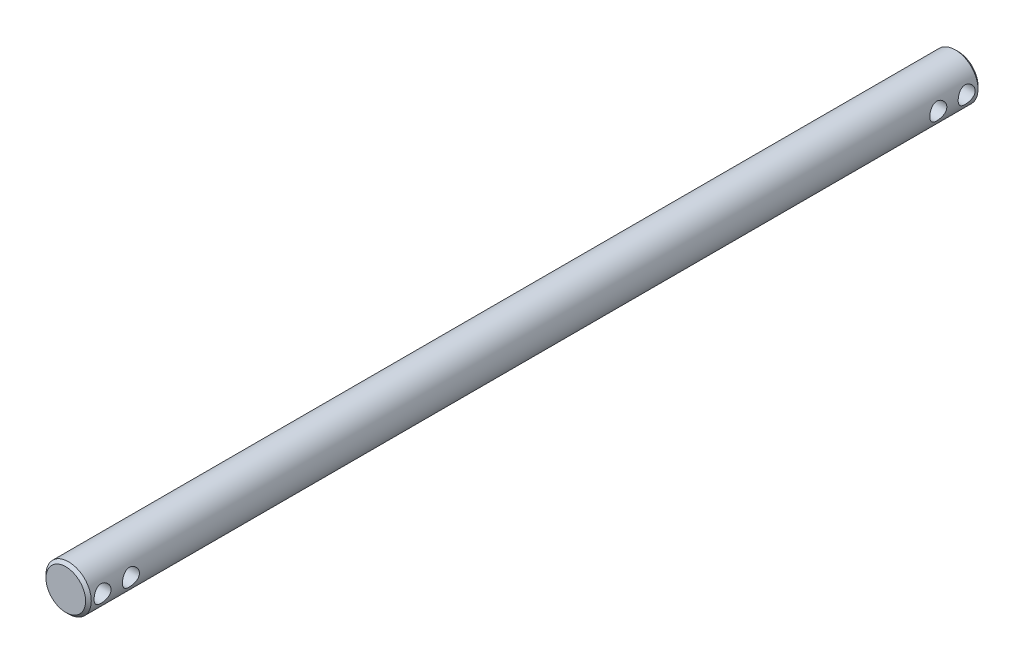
ISO-10303-21;
HEADER;
FILE_DESCRIPTION(('STEP AP214'),'2;1');
FILE_NAME('part.step','',(''),(''),'','','');
FILE_SCHEMA(('AUTOMOTIVE_DESIGN { 1 0 10303 214 1 1 1 1 }'));
ENDSEC;
DATA;
#1=APPLICATION_CONTEXT('core data for automotive mechanical design processes');
#2=APPLICATION_PROTOCOL_DEFINITION('international standard','automotive_design',2000,#1);
#3=PRODUCT_CONTEXT('',#1,'mechanical');
#4=PRODUCT('Part','Part','',(#3));
#5=PRODUCT_RELATED_PRODUCT_CATEGORY('part','',(#4));
#6=PRODUCT_DEFINITION_FORMATION('','',#4);
#7=PRODUCT_DEFINITION_CONTEXT('part definition',#1,'design');
#8=PRODUCT_DEFINITION('design','',#6,#7);
#9=PRODUCT_DEFINITION_SHAPE('','',#8);
#10=(LENGTH_UNIT() NAMED_UNIT(*) SI_UNIT(.MILLI.,.METRE.));
#11=(NAMED_UNIT(*) PLANE_ANGLE_UNIT() SI_UNIT($,.RADIAN.));
#12=(NAMED_UNIT(*) SI_UNIT($,.STERADIAN.) SOLID_ANGLE_UNIT());
#13=UNCERTAINTY_MEASURE_WITH_UNIT(LENGTH_MEASURE(1.E-05),#10,'distance_accuracy_value','');
#14=(GEOMETRIC_REPRESENTATION_CONTEXT(3) GLOBAL_UNCERTAINTY_ASSIGNED_CONTEXT((#13)) GLOBAL_UNIT_ASSIGNED_CONTEXT((#10,
#11,#12)) REPRESENTATION_CONTEXT('',''));
#15=CARTESIAN_POINT('',(0.,0.,0.));
#16=DIRECTION('',(0.,0.,1.));
#17=DIRECTION('',(1.,0.,0.));
#18=AXIS2_PLACEMENT_3D('',#15,#16,#17);
#19=CARTESIAN_POINT('',(0.,0.,315.));
#20=DIRECTION('',(0.,0.,-1.));
#21=DIRECTION('',(-1.,0.,0.));
#22=AXIS2_PLACEMENT_3D('',#19,#20,#21);
#23=CYLINDRICAL_SURFACE('',#22,8.);
#24=CARTESIAN_POINT('',(0.,0.,1.));
#25=DIRECTION('',(0.,0.,1.));
#26=DIRECTION('',(1.,0.,0.));
#27=AXIS2_PLACEMENT_3D('',#24,#25,#26);
#28=CIRCLE('',#27,8.);
#29=CARTESIAN_POINT('',(8.,0.,1.));
#30=VERTEX_POINT('',#29);
#31=EDGE_CURVE('E39',#30,#30,#28,.T.);
#32=ORIENTED_EDGE('',*,*,#31,.T.);
#33=EDGE_LOOP('',(#32));
#34=FACE_BOUND('',#33,.T.);
#35=CARTESIAN_POINT('',(0.,0.,314.));
#36=DIRECTION('',(0.,0.,1.));
#37=DIRECTION('',(1.,0.,0.));
#38=AXIS2_PLACEMENT_3D('',#35,#36,#37);
#39=CIRCLE('',#38,8.);
#40=CARTESIAN_POINT('',(8.,0.,314.));
#41=VERTEX_POINT('',#40);
#42=EDGE_CURVE('E43',#41,#41,#39,.F.);
#43=ORIENTED_EDGE('',*,*,#42,.T.);
#44=EDGE_LOOP('',(#43));
#45=FACE_BOUND('',#44,.T.);
#46=CARTESIAN_POINT('',(-8.,0.,313.));
#47=CARTESIAN_POINT('',(-8.00000434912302,-0.162470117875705,313.000005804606));
#48=CARTESIAN_POINT('',(-7.99500758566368,-0.324900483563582,312.986760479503));
#49=CARTESIAN_POINT('',(-7.97557392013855,-0.644906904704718,312.93434360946));
#50=CARTESIAN_POINT('',(-7.96113837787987,-0.802483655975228,312.895175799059));
#51=CARTESIAN_POINT('',(-7.92437664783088,-1.10812156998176,312.792493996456));
#52=CARTESIAN_POINT('',(-7.90206568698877,-1.25620044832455,312.729026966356));
#53=CARTESIAN_POINT('',(-7.85177535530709,-1.5395986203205,312.579787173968));
#54=CARTESIAN_POINT('',(-7.82379446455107,-1.67491447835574,312.494008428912));
#55=CARTESIAN_POINT('',(-7.76372493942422,-1.93469283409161,312.298774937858));
#56=CARTESIAN_POINT('',(-7.73152005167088,-2.05854146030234,312.188539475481));
#57=CARTESIAN_POINT('',(-7.66720441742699,-2.28648842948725,311.949179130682));
#58=CARTESIAN_POINT('',(-7.63509370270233,-2.39058072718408,311.820048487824));
#59=CARTESIAN_POINT('',(-7.57324941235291,-2.57996404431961,311.540565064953));
#60=CARTESIAN_POINT('',(-7.54365297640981,-2.66438786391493,311.389591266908));
#61=CARTESIAN_POINT('',(-7.49199720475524,-2.80637292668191,311.074303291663));
#62=CARTESIAN_POINT('',(-7.46993485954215,-2.86394489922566,310.909994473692));
#63=CARTESIAN_POINT('',(-7.4370882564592,-2.94816862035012,310.579766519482));
#64=CARTESIAN_POINT('',(-7.42587848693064,-2.97599186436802,310.414189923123));
#65=CARTESIAN_POINT('',(-7.41476122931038,-3.00359113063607,310.080367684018));
#66=CARTESIAN_POINT('',(-7.41484907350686,-3.00337873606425,309.912123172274));
#67=CARTESIAN_POINT('',(-7.42595023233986,-2.97580859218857,309.588460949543));
#68=CARTESIAN_POINT('',(-7.43630937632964,-2.9500761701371,309.432878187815));
#69=CARTESIAN_POINT('',(-7.46569876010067,-2.87488335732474,309.128425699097));
#70=CARTESIAN_POINT('',(-7.48473030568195,-2.82541939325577,308.979556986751));
#71=CARTESIAN_POINT('',(-7.52971404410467,-2.70327497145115,308.689445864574));
#72=CARTESIAN_POINT('',(-7.55579035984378,-2.63017297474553,308.548401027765));
#73=CARTESIAN_POINT('',(-7.61188420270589,-2.46312147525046,308.28010852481));
#74=CARTESIAN_POINT('',(-7.64190308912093,-2.36916477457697,308.152865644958));
#75=CARTESIAN_POINT('',(-7.70496077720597,-2.15563561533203,307.906792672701));
#76=CARTESIAN_POINT('',(-7.73806694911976,-2.03476597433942,307.789102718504));
#77=CARTESIAN_POINT('',(-7.80183456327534,-1.7746251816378,307.575324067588));
#78=CARTESIAN_POINT('',(-7.83249562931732,-1.63535120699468,307.479238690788));
#79=CARTESIAN_POINT('',(-7.88852789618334,-1.33944687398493,307.310139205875));
#80=CARTESIAN_POINT('',(-7.91380996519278,-1.18258142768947,307.237504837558));
#81=CARTESIAN_POINT('',(-7.95557436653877,-0.857673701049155,307.12003479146));
#82=CARTESIAN_POINT('',(-7.97206060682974,-0.689636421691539,307.075186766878));
#83=CARTESIAN_POINT('',(-7.99368886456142,-0.356750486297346,307.016754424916));
#84=CARTESIAN_POINT('',(-7.99938738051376,-0.192207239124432,307.001634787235));
#85=CARTESIAN_POINT('',(-8.00051787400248,0.137144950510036,306.9986178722));
#86=CARTESIAN_POINT('',(-7.99595212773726,0.301953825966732,307.010714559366));
#87=CARTESIAN_POINT('',(-7.97743419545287,0.6205240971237,307.060620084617));
#88=CARTESIAN_POINT('',(-7.9638494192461,0.77446665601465,307.097423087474));
#89=CARTESIAN_POINT('',(-7.92902954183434,1.07388350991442,307.194372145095));
#90=CARTESIAN_POINT('',(-7.90779344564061,1.21935670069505,307.254521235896));
#91=CARTESIAN_POINT('',(-7.85899248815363,1.5024955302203,307.398372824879));
#92=CARTESIAN_POINT('',(-7.83126000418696,1.63980616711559,307.482715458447));
#93=CARTESIAN_POINT('',(-7.77253343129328,1.89878542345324,307.671836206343));
#94=CARTESIAN_POINT('',(-7.74153814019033,2.02044824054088,307.77662186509));
#95=CARTESIAN_POINT('',(-7.6774665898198,2.25206159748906,308.010808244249));
#96=CARTESIAN_POINT('',(-7.64437393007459,2.36092308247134,308.141284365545));
#97=CARTESIAN_POINT('',(-7.58157631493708,2.55542100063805,308.419302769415));
#98=CARTESIAN_POINT('',(-7.55187166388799,2.64105534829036,308.566846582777));
#99=CARTESIAN_POINT('',(-7.49933659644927,2.78675547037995,308.876031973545));
#100=CARTESIAN_POINT('',(-7.47653520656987,2.84671370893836,309.037729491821));
#101=CARTESIAN_POINT('',(-7.4410806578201,2.93815766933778,309.370019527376));
#102=CARTESIAN_POINT('',(-7.42842122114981,2.9696610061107,309.540606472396));
#103=CARTESIAN_POINT('',(-7.41551789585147,3.00172694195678,309.874032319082));
#104=CARTESIAN_POINT('',(-7.41452889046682,3.00414662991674,310.036665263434));
#105=CARTESIAN_POINT('',(-7.42316825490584,2.98273431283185,310.359890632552));
#106=CARTESIAN_POINT('',(-7.43279561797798,2.95890479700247,310.520483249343));
#107=CARTESIAN_POINT('',(-7.46096283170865,2.88711631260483,310.830094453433));
#108=CARTESIAN_POINT('',(-7.47922170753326,2.83991596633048,310.979316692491));
#109=CARTESIAN_POINT('',(-7.52243096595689,2.72339393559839,311.267811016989));
#110=CARTESIAN_POINT('',(-7.54738303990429,2.65406665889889,311.40708057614));
#111=CARTESIAN_POINT('',(-7.60279447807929,2.49104151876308,311.679653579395));
#112=CARTESIAN_POINT('',(-7.63347396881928,2.39625665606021,311.8122615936));
#113=CARTESIAN_POINT('',(-7.69612493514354,2.18668971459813,312.060283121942));
#114=CARTESIAN_POINT('',(-7.7280968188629,2.07190128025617,312.175691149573));
#115=CARTESIAN_POINT('',(-7.79180849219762,1.81816079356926,312.392403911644));
#116=CARTESIAN_POINT('',(-7.82344209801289,1.678237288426,312.492607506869));
#117=CARTESIAN_POINT('',(-7.88109028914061,1.38242644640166,312.668045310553));
#118=CARTESIAN_POINT('',(-7.90710443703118,1.22653786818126,312.743277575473));
#119=CARTESIAN_POINT('',(-7.9514858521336,0.895998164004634,312.868753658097));
#120=CARTESIAN_POINT('',(-7.96947314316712,0.720826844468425,312.917774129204));
#121=CARTESIAN_POINT('',(-7.99372484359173,0.363751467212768,312.983385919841));
#122=CARTESIAN_POINT('',(-7.99999513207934,0.181850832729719,312.999993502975));
#123=CARTESIAN_POINT('',(-8.,0.,313.));
#124=B_SPLINE_CURVE_WITH_KNOTS('',3,(#46,#47,#48,#49,#50,#51,#52,#53,#54,#55,#56,#57,#58,#59,
#60,#61,#62,#63,#64,#65,#66,#67,#68,#69,#70,#71,#72,#73,#74,#75,#76,#77,#78,#79,#80,#81,#82,#83,
#84,#85,#86,#87,#88,#89,#90,#91,#92,#93,#94,#95,#96,#97,#98,#99,#100,#101,#102,#103,#104,#105,
#106,#107,#108,#109,#110,#111,#112,#113,#114,#115,#116,#117,#118,#119,#120,#121,#122,#123),
.UNSPECIFIED.,.T.,.F.,(4,2,2,2,2,2,2,2,2,2,2,2,2,2,2,2,2,2,2,2,2,2,2,2,2,2,2,2,2,2,2,2,2,2,2,2,
2,2,4),(0.,0.486739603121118,0.973409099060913,1.45914273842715,1.94500675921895,
2.44947237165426,2.95409209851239,3.47793349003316,4.00156538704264,4.50371748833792,
5.00566212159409,5.47756690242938,5.94954276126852,6.43044816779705,6.91151981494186,
7.42492306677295,7.93840515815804,8.45982750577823,8.98101799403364,9.47450039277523,
9.96787336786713,10.4422887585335,10.9167658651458,11.4051844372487,11.8937836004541,
12.4107303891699,12.9277235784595,13.4468613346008,13.9656774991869,14.4511752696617,
14.9366270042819,15.4072628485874,15.8780177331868,16.3734494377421,16.8690388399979,
17.3914465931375,17.9138949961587,18.4589703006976,19.0037720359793),.UNSPECIFIED.);
#125=CARTESIAN_POINT('',(-8.,0.,313.));
#126=VERTEX_POINT('',#125);
#127=EDGE_CURVE('E53',#126,#126,#124,.T.);
#128=ORIENTED_EDGE('',*,*,#127,.T.);
#129=EDGE_LOOP('',(#128));
#130=FACE_BOUND('',#129,.T.);
#131=CARTESIAN_POINT('',(8.,0.,307.));
#132=CARTESIAN_POINT('',(8.00000434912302,-0.162470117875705,306.999994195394));
#133=CARTESIAN_POINT('',(7.99500758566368,-0.324900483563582,307.013239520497));
#134=CARTESIAN_POINT('',(7.97557392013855,-0.644906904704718,307.06565639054));
#135=CARTESIAN_POINT('',(7.96113837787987,-0.802483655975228,307.104824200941));
#136=CARTESIAN_POINT('',(7.92437664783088,-1.10812156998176,307.207506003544));
#137=CARTESIAN_POINT('',(7.90206568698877,-1.25620044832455,307.270973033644));
#138=CARTESIAN_POINT('',(7.85177535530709,-1.5395986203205,307.420212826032));
#139=CARTESIAN_POINT('',(7.82379446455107,-1.67491447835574,307.505991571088));
#140=CARTESIAN_POINT('',(7.76372493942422,-1.93469283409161,307.701225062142));
#141=CARTESIAN_POINT('',(7.73152005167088,-2.05854146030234,307.811460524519));
#142=CARTESIAN_POINT('',(7.66720441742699,-2.28648842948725,308.050820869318));
#143=CARTESIAN_POINT('',(7.63509370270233,-2.39058072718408,308.179951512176));
#144=CARTESIAN_POINT('',(7.57324941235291,-2.57996404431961,308.459434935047));
#145=CARTESIAN_POINT('',(7.54365297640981,-2.66438786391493,308.610408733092));
#146=CARTESIAN_POINT('',(7.49199720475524,-2.80637292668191,308.925696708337));
#147=CARTESIAN_POINT('',(7.46993485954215,-2.86394489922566,309.090005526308));
#148=CARTESIAN_POINT('',(7.4370882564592,-2.94816862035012,309.420233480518));
#149=CARTESIAN_POINT('',(7.42587848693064,-2.97599186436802,309.585810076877));
#150=CARTESIAN_POINT('',(7.41476122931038,-3.00359113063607,309.919632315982));
#151=CARTESIAN_POINT('',(7.41484907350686,-3.00337873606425,310.087876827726));
#152=CARTESIAN_POINT('',(7.42595023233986,-2.97580859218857,310.411539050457));
#153=CARTESIAN_POINT('',(7.43630937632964,-2.9500761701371,310.567121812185));
#154=CARTESIAN_POINT('',(7.46569876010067,-2.87488335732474,310.871574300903));
#155=CARTESIAN_POINT('',(7.48473030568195,-2.82541939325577,311.020443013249));
#156=CARTESIAN_POINT('',(7.52971404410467,-2.70327497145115,311.310554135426));
#157=CARTESIAN_POINT('',(7.55579035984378,-2.63017297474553,311.451598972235));
#158=CARTESIAN_POINT('',(7.61188420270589,-2.46312147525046,311.71989147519));
#159=CARTESIAN_POINT('',(7.64190308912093,-2.36916477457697,311.847134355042));
#160=CARTESIAN_POINT('',(7.70496077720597,-2.15563561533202,312.093207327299));
#161=CARTESIAN_POINT('',(7.73806694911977,-2.0347659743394,312.210897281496));
#162=CARTESIAN_POINT('',(7.80183456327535,-1.77462518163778,312.424675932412));
#163=CARTESIAN_POINT('',(7.83249562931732,-1.63535120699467,312.520761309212));
#164=CARTESIAN_POINT('',(7.88852789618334,-1.33944687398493,312.689860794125));
#165=CARTESIAN_POINT('',(7.91380996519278,-1.18258142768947,312.762495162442));
#166=CARTESIAN_POINT('',(7.95557436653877,-0.857673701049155,312.87996520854));
#167=CARTESIAN_POINT('',(7.97206060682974,-0.689636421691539,312.924813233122));
#168=CARTESIAN_POINT('',(7.99368886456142,-0.356750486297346,312.983245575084));
#169=CARTESIAN_POINT('',(7.99938738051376,-0.192207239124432,312.998365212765));
#170=CARTESIAN_POINT('',(8.00051787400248,0.137144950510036,313.0013821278));
#171=CARTESIAN_POINT('',(7.99595212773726,0.301953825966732,312.989285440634));
#172=CARTESIAN_POINT('',(7.97743419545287,0.620524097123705,312.939379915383));
#173=CARTESIAN_POINT('',(7.9638494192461,0.774466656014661,312.902576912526));
#174=CARTESIAN_POINT('',(7.92902954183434,1.07388350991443,312.805627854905));
#175=CARTESIAN_POINT('',(7.90779344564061,1.21935670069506,312.745478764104));
#176=CARTESIAN_POINT('',(7.85899248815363,1.5024955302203,312.601627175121));
#177=CARTESIAN_POINT('',(7.83126000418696,1.63980616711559,312.517284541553));
#178=CARTESIAN_POINT('',(7.77253343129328,1.89878542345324,312.328163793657));
#179=CARTESIAN_POINT('',(7.74153814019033,2.02044824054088,312.22337813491));
#180=CARTESIAN_POINT('',(7.6774665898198,2.25206159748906,311.989191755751));
#181=CARTESIAN_POINT('',(7.64437393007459,2.36092308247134,311.858715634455));
#182=CARTESIAN_POINT('',(7.58157631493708,2.55542100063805,311.580697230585));
#183=CARTESIAN_POINT('',(7.55187166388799,2.64105534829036,311.433153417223));
#184=CARTESIAN_POINT('',(7.49933659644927,2.78675547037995,311.123968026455));
#185=CARTESIAN_POINT('',(7.47653520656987,2.84671370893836,310.962270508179));
#186=CARTESIAN_POINT('',(7.4410806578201,2.93815766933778,310.629980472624));
#187=CARTESIAN_POINT('',(7.42842122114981,2.9696610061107,310.459393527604));
#188=CARTESIAN_POINT('',(7.41551789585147,3.00172694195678,310.125967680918));
#189=CARTESIAN_POINT('',(7.41452889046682,3.00414662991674,309.963334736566));
#190=CARTESIAN_POINT('',(7.42316825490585,2.98273431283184,309.640109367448));
#191=CARTESIAN_POINT('',(7.43279561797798,2.95890479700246,309.479516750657));
#192=CARTESIAN_POINT('',(7.46096283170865,2.88711631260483,309.169905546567));
#193=CARTESIAN_POINT('',(7.47922170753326,2.83991596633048,309.020683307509));
#194=CARTESIAN_POINT('',(7.52243096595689,2.72339393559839,308.732188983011));
#195=CARTESIAN_POINT('',(7.54738303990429,2.65406665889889,308.59291942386));
#196=CARTESIAN_POINT('',(7.60279447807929,2.49104151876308,308.320346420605));
#197=CARTESIAN_POINT('',(7.63347396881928,2.39625665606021,308.1877384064));
#198=CARTESIAN_POINT('',(7.69612493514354,2.18668971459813,307.939716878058));
#199=CARTESIAN_POINT('',(7.7280968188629,2.07190128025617,307.824308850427));
#200=CARTESIAN_POINT('',(7.79180849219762,1.81816079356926,307.607596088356));
#201=CARTESIAN_POINT('',(7.82344209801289,1.678237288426,307.507392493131));
#202=CARTESIAN_POINT('',(7.88109028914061,1.38242644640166,307.331954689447));
#203=CARTESIAN_POINT('',(7.90710443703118,1.22653786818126,307.256722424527));
#204=CARTESIAN_POINT('',(7.9514858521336,0.895998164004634,307.131246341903));
#205=CARTESIAN_POINT('',(7.96947314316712,0.720826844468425,307.082225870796));
#206=CARTESIAN_POINT('',(7.99372484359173,0.363751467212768,307.016614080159));
#207=CARTESIAN_POINT('',(7.99999513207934,0.181850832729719,307.000006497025));
#208=CARTESIAN_POINT('',(8.,0.,307.));
#209=B_SPLINE_CURVE_WITH_KNOTS('',3,(#131,#132,#133,#134,#135,#136,#137,#138,#139,#140,#141,
#142,#143,#144,#145,#146,#147,#148,#149,#150,#151,#152,#153,#154,#155,#156,#157,#158,#159,#160,
#161,#162,#163,#164,#165,#166,#167,#168,#169,#170,#171,#172,#173,#174,#175,#176,#177,#178,#179,
#180,#181,#182,#183,#184,#185,#186,#187,#188,#189,#190,#191,#192,#193,#194,#195,#196,#197,#198,
#199,#200,#201,#202,#203,#204,#205,#206,#207,#208),.UNSPECIFIED.,.T.,.F.,(4,2,2,2,2,2,2,2,2,2,2,
2,2,2,2,2,2,2,2,2,2,2,2,2,2,2,2,2,2,2,2,2,2,2,2,2,2,2,4),(0.,0.486739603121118,
0.973409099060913,1.45914273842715,1.94500675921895,2.44947237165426,2.95409209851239,
3.47793349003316,4.00156538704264,4.50371748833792,5.00566212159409,5.47756690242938,
5.94954276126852,6.43044816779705,6.91151981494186,7.42492306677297,7.93840515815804,
8.45982750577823,8.98101799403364,9.47450039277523,9.96787336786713,10.4422887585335,
10.9167658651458,11.4051844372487,11.8937836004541,12.4107303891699,12.9277235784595,
13.4468613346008,13.9656774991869,14.4511752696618,14.9366270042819,15.4072628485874,
15.8780177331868,16.3734494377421,16.8690388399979,17.3914465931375,17.9138949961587,
18.4589703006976,19.0037720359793),.UNSPECIFIED.);
#210=CARTESIAN_POINT('',(8.,0.,307.));
#211=VERTEX_POINT('',#210);
#212=EDGE_CURVE('E61',#211,#211,#209,.T.);
#213=ORIENTED_EDGE('',*,*,#212,.T.);
#214=EDGE_LOOP('',(#213));
#215=FACE_BOUND('',#214,.T.);
#216=CARTESIAN_POINT('',(-8.,0.,303.));
#217=CARTESIAN_POINT('',(-8.00000434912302,-0.162470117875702,303.000005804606));
#218=CARTESIAN_POINT('',(-7.99500758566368,-0.324900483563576,302.986760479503));
#219=CARTESIAN_POINT('',(-7.97557392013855,-0.644906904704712,302.93434360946));
#220=CARTESIAN_POINT('',(-7.96113837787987,-0.802483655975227,302.895175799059));
#221=CARTESIAN_POINT('',(-7.92437664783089,-1.10812156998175,302.792493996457));
#222=CARTESIAN_POINT('',(-7.90206568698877,-1.25620044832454,302.729026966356));
#223=CARTESIAN_POINT('',(-7.8517753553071,-1.53959862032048,302.579787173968));
#224=CARTESIAN_POINT('',(-7.82379446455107,-1.67491447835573,302.494008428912));
#225=CARTESIAN_POINT('',(-7.76372493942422,-1.93469283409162,302.298774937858));
#226=CARTESIAN_POINT('',(-7.73152005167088,-2.05854146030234,302.188539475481));
#227=CARTESIAN_POINT('',(-7.66720441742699,-2.28648842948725,301.949179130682));
#228=CARTESIAN_POINT('',(-7.63509370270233,-2.39058072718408,301.820048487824));
#229=CARTESIAN_POINT('',(-7.57324941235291,-2.57996404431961,301.540565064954));
#230=CARTESIAN_POINT('',(-7.54365297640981,-2.66438786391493,301.389591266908));
#231=CARTESIAN_POINT('',(-7.49199720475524,-2.80637292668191,301.074303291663));
#232=CARTESIAN_POINT('',(-7.46993485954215,-2.86394489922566,300.909994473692));
#233=CARTESIAN_POINT('',(-7.4370882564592,-2.94816862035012,300.579766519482));
#234=CARTESIAN_POINT('',(-7.42587848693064,-2.97599186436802,300.414189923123));
#235=CARTESIAN_POINT('',(-7.41476122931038,-3.00359113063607,300.080367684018));
#236=CARTESIAN_POINT('',(-7.41484907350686,-3.00337873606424,299.912123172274));
#237=CARTESIAN_POINT('',(-7.42595023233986,-2.97580859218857,299.588460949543));
#238=CARTESIAN_POINT('',(-7.43630937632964,-2.95007617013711,299.432878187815));
#239=CARTESIAN_POINT('',(-7.46569876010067,-2.87488335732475,299.128425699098));
#240=CARTESIAN_POINT('',(-7.48473030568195,-2.82541939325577,298.979556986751));
#241=CARTESIAN_POINT('',(-7.52971404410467,-2.70327497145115,298.689445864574));
#242=CARTESIAN_POINT('',(-7.55579035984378,-2.63017297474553,298.548401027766));
#243=CARTESIAN_POINT('',(-7.61188420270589,-2.46312147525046,298.28010852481));
#244=CARTESIAN_POINT('',(-7.64190308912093,-2.36916477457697,298.152865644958));
#245=CARTESIAN_POINT('',(-7.70496077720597,-2.15563561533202,297.906792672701));
#246=CARTESIAN_POINT('',(-7.73806694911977,-2.0347659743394,297.789102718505));
#247=CARTESIAN_POINT('',(-7.80183456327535,-1.77462518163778,297.575324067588));
#248=CARTESIAN_POINT('',(-7.83249562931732,-1.63535120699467,297.479238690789));
#249=CARTESIAN_POINT('',(-7.88852789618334,-1.33944687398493,297.310139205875));
#250=CARTESIAN_POINT('',(-7.91380996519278,-1.18258142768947,297.237504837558));
#251=CARTESIAN_POINT('',(-7.95557436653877,-0.857673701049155,297.12003479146));
#252=CARTESIAN_POINT('',(-7.97206060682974,-0.689636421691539,297.075186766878));
#253=CARTESIAN_POINT('',(-7.99368886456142,-0.356750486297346,297.016754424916));
#254=CARTESIAN_POINT('',(-7.99938738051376,-0.192207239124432,297.001634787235));
#255=CARTESIAN_POINT('',(-8.00051787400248,0.137144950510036,296.9986178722));
#256=CARTESIAN_POINT('',(-7.99595212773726,0.301953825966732,297.010714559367));
#257=CARTESIAN_POINT('',(-7.97743419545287,0.620524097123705,297.060620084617));
#258=CARTESIAN_POINT('',(-7.9638494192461,0.774466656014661,297.097423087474));
#259=CARTESIAN_POINT('',(-7.92902954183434,1.07388350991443,297.194372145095));
#260=CARTESIAN_POINT('',(-7.90779344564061,1.21935670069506,297.254521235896));
#261=CARTESIAN_POINT('',(-7.85899248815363,1.50249553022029,297.398372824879));
#262=CARTESIAN_POINT('',(-7.83126000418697,1.63980616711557,297.482715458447));
#263=CARTESIAN_POINT('',(-7.77253343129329,1.89878542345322,297.671836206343));
#264=CARTESIAN_POINT('',(-7.74153814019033,2.02044824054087,297.77662186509));
#265=CARTESIAN_POINT('',(-7.6774665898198,2.25206159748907,298.010808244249));
#266=CARTESIAN_POINT('',(-7.64437393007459,2.36092308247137,298.141284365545));
#267=CARTESIAN_POINT('',(-7.58157631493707,2.55542100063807,298.419302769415));
#268=CARTESIAN_POINT('',(-7.55187166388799,2.64105534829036,298.566846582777));
#269=CARTESIAN_POINT('',(-7.49933659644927,2.78675547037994,298.876031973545));
#270=CARTESIAN_POINT('',(-7.47653520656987,2.84671370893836,299.037729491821));
#271=CARTESIAN_POINT('',(-7.4410806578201,2.93815766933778,299.370019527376));
#272=CARTESIAN_POINT('',(-7.42842122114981,2.9696610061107,299.540606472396));
#273=CARTESIAN_POINT('',(-7.41551789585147,3.00172694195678,299.874032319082));
#274=CARTESIAN_POINT('',(-7.41452889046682,3.00414662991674,300.036665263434));
#275=CARTESIAN_POINT('',(-7.42316825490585,2.98273431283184,300.359890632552));
#276=CARTESIAN_POINT('',(-7.43279561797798,2.95890479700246,300.520483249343));
#277=CARTESIAN_POINT('',(-7.46096283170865,2.88711631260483,300.830094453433));
#278=CARTESIAN_POINT('',(-7.47922170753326,2.83991596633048,300.979316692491));
#279=CARTESIAN_POINT('',(-7.52243096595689,2.72339393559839,301.267811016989));
#280=CARTESIAN_POINT('',(-7.54738303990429,2.65406665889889,301.40708057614));
#281=CARTESIAN_POINT('',(-7.60279447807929,2.49104151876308,301.679653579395));
#282=CARTESIAN_POINT('',(-7.63347396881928,2.39625665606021,301.8122615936));
#283=CARTESIAN_POINT('',(-7.69612493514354,2.18668971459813,302.060283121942));
#284=CARTESIAN_POINT('',(-7.7280968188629,2.07190128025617,302.175691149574));
#285=CARTESIAN_POINT('',(-7.79180849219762,1.81816079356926,302.392403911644));
#286=CARTESIAN_POINT('',(-7.82344209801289,1.678237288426,302.492607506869));
#287=CARTESIAN_POINT('',(-7.88109028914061,1.38242644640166,302.668045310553));
#288=CARTESIAN_POINT('',(-7.90710443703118,1.22653786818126,302.743277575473));
#289=CARTESIAN_POINT('',(-7.9514858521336,0.89599816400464,302.868753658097));
#290=CARTESIAN_POINT('',(-7.96947314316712,0.720826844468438,302.917774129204));
#291=CARTESIAN_POINT('',(-7.99372484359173,0.363751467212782,302.983385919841));
#292=CARTESIAN_POINT('',(-7.99999513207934,0.181850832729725,302.999993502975));
#293=CARTESIAN_POINT('',(-8.,0.,303.));
#294=B_SPLINE_CURVE_WITH_KNOTS('',3,(#216,#217,#218,#219,#220,#221,#222,#223,#224,#225,#226,
#227,#228,#229,#230,#231,#232,#233,#234,#235,#236,#237,#238,#239,#240,#241,#242,#243,#244,#245,
#246,#247,#248,#249,#250,#251,#252,#253,#254,#255,#256,#257,#258,#259,#260,#261,#262,#263,#264,
#265,#266,#267,#268,#269,#270,#271,#272,#273,#274,#275,#276,#277,#278,#279,#280,#281,#282,#283,
#284,#285,#286,#287,#288,#289,#290,#291,#292,#293),.UNSPECIFIED.,.T.,.F.,(4,2,2,2,2,2,2,2,2,2,2,
2,2,2,2,2,2,2,2,2,2,2,2,2,2,2,2,2,2,2,2,2,2,2,2,2,2,2,4),(0.,0.486739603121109,
0.973409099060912,1.45914273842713,1.94500675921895,2.44947237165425,2.95409209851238,
3.47793349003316,4.00156538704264,4.50371748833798,5.00566212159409,5.47756690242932,
5.94954276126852,6.43044816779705,6.91151981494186,7.42492306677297,7.93840515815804,
8.45982750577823,8.98101799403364,9.47450039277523,9.96787336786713,10.4422887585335,
10.9167658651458,11.4051844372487,11.8937836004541,12.4107303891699,12.9277235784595,
13.4468613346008,13.9656774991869,14.4511752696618,14.9366270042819,15.4072628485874,
15.8780177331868,16.3734494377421,16.8690388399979,17.3914465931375,17.9138949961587,
18.4589703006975,19.0037720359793),.UNSPECIFIED.);
#295=CARTESIAN_POINT('',(-8.,0.,303.));
#296=VERTEX_POINT('',#295);
#297=EDGE_CURVE('E89',#296,#296,#294,.T.);
#298=ORIENTED_EDGE('',*,*,#297,.T.);
#299=EDGE_LOOP('',(#298));
#300=FACE_BOUND('',#299,.T.);
#301=CARTESIAN_POINT('',(8.,0.,297.));
#302=CARTESIAN_POINT('',(8.00000434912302,-0.162470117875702,296.999994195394));
#303=CARTESIAN_POINT('',(7.99500758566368,-0.324900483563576,297.013239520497));
#304=CARTESIAN_POINT('',(7.97557392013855,-0.644906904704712,297.06565639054));
#305=CARTESIAN_POINT('',(7.96113837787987,-0.802483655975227,297.104824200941));
#306=CARTESIAN_POINT('',(7.92437664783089,-1.10812156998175,297.207506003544));
#307=CARTESIAN_POINT('',(7.90206568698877,-1.25620044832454,297.270973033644));
#308=CARTESIAN_POINT('',(7.8517753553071,-1.53959862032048,297.420212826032));
#309=CARTESIAN_POINT('',(7.82379446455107,-1.67491447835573,297.505991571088));
#310=CARTESIAN_POINT('',(7.76372493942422,-1.93469283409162,297.701225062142));
#311=CARTESIAN_POINT('',(7.73152005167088,-2.05854146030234,297.811460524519));
#312=CARTESIAN_POINT('',(7.66720441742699,-2.28648842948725,298.050820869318));
#313=CARTESIAN_POINT('',(7.63509370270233,-2.39058072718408,298.179951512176));
#314=CARTESIAN_POINT('',(7.57324941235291,-2.57996404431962,298.459434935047));
#315=CARTESIAN_POINT('',(7.5436529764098,-2.66438786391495,298.610408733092));
#316=CARTESIAN_POINT('',(7.49199720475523,-2.80637292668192,298.925696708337));
#317=CARTESIAN_POINT('',(7.46993485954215,-2.86394489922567,299.090005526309));
#318=CARTESIAN_POINT('',(7.4370882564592,-2.94816862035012,299.420233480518));
#319=CARTESIAN_POINT('',(7.42587848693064,-2.97599186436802,299.585810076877));
#320=CARTESIAN_POINT('',(7.41476122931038,-3.00359113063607,299.919632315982));
#321=CARTESIAN_POINT('',(7.41484907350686,-3.00337873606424,300.087876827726));
#322=CARTESIAN_POINT('',(7.42595023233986,-2.97580859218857,300.411539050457));
#323=CARTESIAN_POINT('',(7.43630937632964,-2.95007617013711,300.567121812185));
#324=CARTESIAN_POINT('',(7.46569876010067,-2.87488335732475,300.871574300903));
#325=CARTESIAN_POINT('',(7.48473030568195,-2.82541939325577,301.020443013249));
#326=CARTESIAN_POINT('',(7.52971404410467,-2.70327497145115,301.310554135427));
#327=CARTESIAN_POINT('',(7.55579035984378,-2.63017297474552,301.451598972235));
#328=CARTESIAN_POINT('',(7.61188420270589,-2.46312147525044,301.71989147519));
#329=CARTESIAN_POINT('',(7.64190308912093,-2.36916477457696,301.847134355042));
#330=CARTESIAN_POINT('',(7.70496077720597,-2.15563561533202,302.093207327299));
#331=CARTESIAN_POINT('',(7.73806694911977,-2.0347659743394,302.210897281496));
#332=CARTESIAN_POINT('',(7.80183456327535,-1.77462518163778,302.424675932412));
#333=CARTESIAN_POINT('',(7.83249562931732,-1.63535120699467,302.520761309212));
#334=CARTESIAN_POINT('',(7.88852789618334,-1.33944687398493,302.689860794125));
#335=CARTESIAN_POINT('',(7.91380996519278,-1.18258142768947,302.762495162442));
#336=CARTESIAN_POINT('',(7.95557436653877,-0.857673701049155,302.87996520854));
#337=CARTESIAN_POINT('',(7.97206060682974,-0.689636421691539,302.924813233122));
#338=CARTESIAN_POINT('',(7.99368886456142,-0.356750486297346,302.983245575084));
#339=CARTESIAN_POINT('',(7.99938738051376,-0.192207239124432,302.998365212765));
#340=CARTESIAN_POINT('',(8.00051787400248,0.137144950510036,303.0013821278));
#341=CARTESIAN_POINT('',(7.99595212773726,0.301953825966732,302.989285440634));
#342=CARTESIAN_POINT('',(7.97743419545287,0.620524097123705,302.939379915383));
#343=CARTESIAN_POINT('',(7.9638494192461,0.774466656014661,302.902576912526));
#344=CARTESIAN_POINT('',(7.92902954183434,1.07388350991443,302.805627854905));
#345=CARTESIAN_POINT('',(7.90779344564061,1.21935670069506,302.745478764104));
#346=CARTESIAN_POINT('',(7.85899248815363,1.50249553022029,302.601627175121));
#347=CARTESIAN_POINT('',(7.83126000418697,1.63980616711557,302.517284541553));
#348=CARTESIAN_POINT('',(7.77253343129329,1.89878542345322,302.328163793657));
#349=CARTESIAN_POINT('',(7.74153814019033,2.02044824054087,302.22337813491));
#350=CARTESIAN_POINT('',(7.6774665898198,2.25206159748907,301.989191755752));
#351=CARTESIAN_POINT('',(7.64437393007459,2.36092308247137,301.858715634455));
#352=CARTESIAN_POINT('',(7.58157631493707,2.55542100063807,301.580697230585));
#353=CARTESIAN_POINT('',(7.55187166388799,2.64105534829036,301.433153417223));
#354=CARTESIAN_POINT('',(7.49933659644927,2.78675547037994,301.123968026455));
#355=CARTESIAN_POINT('',(7.47653520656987,2.84671370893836,300.962270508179));
#356=CARTESIAN_POINT('',(7.4410806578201,2.93815766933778,300.629980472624));
#357=CARTESIAN_POINT('',(7.42842122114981,2.9696610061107,300.459393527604));
#358=CARTESIAN_POINT('',(7.41551789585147,3.00172694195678,300.125967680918));
#359=CARTESIAN_POINT('',(7.41452889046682,3.00414662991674,299.963334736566));
#360=CARTESIAN_POINT('',(7.42316825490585,2.98273431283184,299.640109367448));
#361=CARTESIAN_POINT('',(7.43279561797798,2.95890479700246,299.479516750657));
#362=CARTESIAN_POINT('',(7.46096283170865,2.88711631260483,299.169905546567));
#363=CARTESIAN_POINT('',(7.47922170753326,2.83991596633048,299.020683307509));
#364=CARTESIAN_POINT('',(7.52243096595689,2.72339393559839,298.732188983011));
#365=CARTESIAN_POINT('',(7.54738303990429,2.65406665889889,298.59291942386));
#366=CARTESIAN_POINT('',(7.60279447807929,2.49104151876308,298.320346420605));
#367=CARTESIAN_POINT('',(7.63347396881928,2.39625665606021,298.1877384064));
#368=CARTESIAN_POINT('',(7.69612493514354,2.18668971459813,297.939716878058));
#369=CARTESIAN_POINT('',(7.7280968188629,2.07190128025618,297.824308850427));
#370=CARTESIAN_POINT('',(7.79180849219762,1.81816079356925,297.607596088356));
#371=CARTESIAN_POINT('',(7.82344209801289,1.67823728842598,297.507392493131));
#372=CARTESIAN_POINT('',(7.88109028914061,1.38242644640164,297.331954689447));
#373=CARTESIAN_POINT('',(7.90710443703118,1.22653786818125,297.256722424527));
#374=CARTESIAN_POINT('',(7.9514858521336,0.895998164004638,297.131246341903));
#375=CARTESIAN_POINT('',(7.96947314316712,0.720826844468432,297.082225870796));
#376=CARTESIAN_POINT('',(7.99372484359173,0.363751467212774,297.016614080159));
#377=CARTESIAN_POINT('',(7.99999513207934,0.181850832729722,297.000006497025));
#378=CARTESIAN_POINT('',(8.,0.,297.));
#379=B_SPLINE_CURVE_WITH_KNOTS('',3,(#301,#302,#303,#304,#305,#306,#307,#308,#309,#310,#311,
#312,#313,#314,#315,#316,#317,#318,#319,#320,#321,#322,#323,#324,#325,#326,#327,#328,#329,#330,
#331,#332,#333,#334,#335,#336,#337,#338,#339,#340,#341,#342,#343,#344,#345,#346,#347,#348,#349,
#350,#351,#352,#353,#354,#355,#356,#357,#358,#359,#360,#361,#362,#363,#364,#365,#366,#367,#368,
#369,#370,#371,#372,#373,#374,#375,#376,#377,#378),.UNSPECIFIED.,.T.,.F.,(4,2,2,2,2,2,2,2,2,2,2,
2,2,2,2,2,2,2,2,2,2,2,2,2,2,2,2,2,2,2,2,2,2,2,2,2,2,2,4),(0.,0.486739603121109,
0.973409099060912,1.45914273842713,1.94500675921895,2.44947237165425,2.95409209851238,
3.47793349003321,4.00156538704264,4.50371748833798,5.00566212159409,5.47756690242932,
5.94954276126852,6.43044816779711,6.91151981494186,7.42492306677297,7.93840515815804,
8.45982750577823,8.98101799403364,9.47450039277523,9.96787336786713,10.4422887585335,
10.9167658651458,11.4051844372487,11.8937836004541,12.4107303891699,12.9277235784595,
13.4468613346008,13.9656774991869,14.4511752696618,14.9366270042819,15.4072628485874,
15.8780177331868,16.3734494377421,16.8690388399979,17.3914465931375,17.9138949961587,
18.4589703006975,19.0037720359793),.UNSPECIFIED.);
#380=CARTESIAN_POINT('',(8.,0.,297.));
#381=VERTEX_POINT('',#380);
#382=EDGE_CURVE('E60',#381,#381,#379,.T.);
#383=ORIENTED_EDGE('',*,*,#382,.T.);
#384=EDGE_LOOP('',(#383));
#385=FACE_BOUND('',#384,.T.);
#386=CARTESIAN_POINT('',(-8.,0.,18.));
#387=CARTESIAN_POINT('',(-8.00000434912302,-0.162470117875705,18.0000058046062));
#388=CARTESIAN_POINT('',(-7.99500758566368,-0.324900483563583,17.9867604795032));
#389=CARTESIAN_POINT('',(-7.97557392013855,-0.644906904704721,17.9343436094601));
#390=CARTESIAN_POINT('',(-7.96113837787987,-0.802483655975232,17.8951757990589));
#391=CARTESIAN_POINT('',(-7.92437664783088,-1.10812156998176,17.7924939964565));
#392=CARTESIAN_POINT('',(-7.90206568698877,-1.25620044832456,17.7290269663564));
#393=CARTESIAN_POINT('',(-7.85177535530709,-1.53959862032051,17.5797871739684));
#394=CARTESIAN_POINT('',(-7.82379446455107,-1.67491447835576,17.4940084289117));
#395=CARTESIAN_POINT('',(-7.76372493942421,-1.93469283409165,17.2987749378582));
#396=CARTESIAN_POINT('',(-7.73152005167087,-2.05854146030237,17.1885394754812));
#397=CARTESIAN_POINT('',(-7.66720441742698,-2.28648842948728,16.9491791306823));
#398=CARTESIAN_POINT('',(-7.63509370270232,-2.39058072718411,16.8200484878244));
#399=CARTESIAN_POINT('',(-7.5732494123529,-2.57996404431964,16.5405650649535));
#400=CARTESIAN_POINT('',(-7.5436529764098,-2.66438786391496,16.3895912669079));
#401=CARTESIAN_POINT('',(-7.49199720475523,-2.80637292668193,16.0743032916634));
#402=CARTESIAN_POINT('',(-7.46993485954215,-2.86394489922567,15.9099944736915));
#403=CARTESIAN_POINT('',(-7.43708825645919,-2.94816862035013,15.5797665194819));
#404=CARTESIAN_POINT('',(-7.42587848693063,-2.97599186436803,15.414189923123));
#405=CARTESIAN_POINT('',(-7.41476122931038,-3.00359113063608,15.0803676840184));
#406=CARTESIAN_POINT('',(-7.41484907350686,-3.00337873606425,14.9121231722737));
#407=CARTESIAN_POINT('',(-7.42595023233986,-2.97580859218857,14.5884609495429));
#408=CARTESIAN_POINT('',(-7.43630937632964,-2.95007617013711,14.4328781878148));
#409=CARTESIAN_POINT('',(-7.46569876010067,-2.87488335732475,14.1284256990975));
#410=CARTESIAN_POINT('',(-7.48473030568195,-2.82541939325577,13.979556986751));
#411=CARTESIAN_POINT('',(-7.52971404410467,-2.70327497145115,13.6894458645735));
#412=CARTESIAN_POINT('',(-7.55579035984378,-2.63017297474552,13.5484010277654));
#413=CARTESIAN_POINT('',(-7.61188420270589,-2.46312147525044,13.28010852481));
#414=CARTESIAN_POINT('',(-7.64190308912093,-2.36916477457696,13.1528656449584));
#415=CARTESIAN_POINT('',(-7.70496077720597,-2.15563561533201,12.9067926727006));
#416=CARTESIAN_POINT('',(-7.73806694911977,-2.03476597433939,12.7891027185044));
#417=CARTESIAN_POINT('',(-7.80183456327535,-1.77462518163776,12.5753240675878));
#418=CARTESIAN_POINT('',(-7.83249562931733,-1.63535120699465,12.4792386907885));
#419=CARTESIAN_POINT('',(-7.88852789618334,-1.33944687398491,12.3101392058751));
#420=CARTESIAN_POINT('',(-7.91380996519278,-1.18258142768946,12.2375048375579));
#421=CARTESIAN_POINT('',(-7.95557436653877,-0.857673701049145,12.1200347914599));
#422=CARTESIAN_POINT('',(-7.97206060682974,-0.689636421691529,12.0751867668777));
#423=CARTESIAN_POINT('',(-7.99368886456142,-0.356750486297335,12.0167544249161));
#424=CARTESIAN_POINT('',(-7.99938738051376,-0.19220723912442,12.001634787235));
#425=CARTESIAN_POINT('',(-8.00051787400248,0.13714495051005,11.9986178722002));
#426=CARTESIAN_POINT('',(-7.99595212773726,0.301953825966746,12.0107145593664));
#427=CARTESIAN_POINT('',(-7.97743419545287,0.620524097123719,12.0606200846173));
#428=CARTESIAN_POINT('',(-7.9638494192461,0.774466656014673,12.0974230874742));
#429=CARTESIAN_POINT('',(-7.92902954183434,1.07388350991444,12.1943721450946));
#430=CARTESIAN_POINT('',(-7.9077934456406,1.21935670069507,12.2545212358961));
#431=CARTESIAN_POINT('',(-7.85899248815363,1.50249553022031,12.3983728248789));
#432=CARTESIAN_POINT('',(-7.83126000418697,1.63980616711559,12.4827154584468));
#433=CARTESIAN_POINT('',(-7.77253343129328,1.89878542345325,12.6718362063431));
#434=CARTESIAN_POINT('',(-7.74153814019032,2.0204482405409,12.7766218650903));
#435=CARTESIAN_POINT('',(-7.67746658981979,2.25206159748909,13.0108082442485));
#436=CARTESIAN_POINT('',(-7.64437393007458,2.36092308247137,13.1412843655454));
#437=CARTESIAN_POINT('',(-7.58157631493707,2.55542100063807,13.4193027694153));
#438=CARTESIAN_POINT('',(-7.55187166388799,2.64105534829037,13.566846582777));
#439=CARTESIAN_POINT('',(-7.49933659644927,2.78675547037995,13.8760319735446));
#440=CARTESIAN_POINT('',(-7.47653520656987,2.84671370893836,14.0377294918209));
#441=CARTESIAN_POINT('',(-7.4410806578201,2.93815766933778,14.3700195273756));
#442=CARTESIAN_POINT('',(-7.42842122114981,2.9696610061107,14.5406064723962));
#443=CARTESIAN_POINT('',(-7.41551789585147,3.00172694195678,14.8740323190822));
#444=CARTESIAN_POINT('',(-7.41452889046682,3.00414662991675,15.0366652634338));
#445=CARTESIAN_POINT('',(-7.42316825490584,2.98273431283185,15.3598906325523));
#446=CARTESIAN_POINT('',(-7.43279561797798,2.95890479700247,15.5204832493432));
#447=CARTESIAN_POINT('',(-7.46096283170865,2.88711631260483,15.8300944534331));
#448=CARTESIAN_POINT('',(-7.47922170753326,2.83991596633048,15.9793166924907));
#449=CARTESIAN_POINT('',(-7.52243096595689,2.72339393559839,16.2678110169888));
#450=CARTESIAN_POINT('',(-7.54738303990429,2.65406665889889,16.4070805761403));
#451=CARTESIAN_POINT('',(-7.60279447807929,2.49104151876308,16.6796535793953));
#452=CARTESIAN_POINT('',(-7.63347396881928,2.3962566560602,16.8122615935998));
#453=CARTESIAN_POINT('',(-7.69612493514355,2.18668971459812,17.0602831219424));
#454=CARTESIAN_POINT('',(-7.7280968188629,2.07190128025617,17.1756911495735));
#455=CARTESIAN_POINT('',(-7.79180849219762,1.81816079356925,17.3924039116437));
#456=CARTESIAN_POINT('',(-7.82344209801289,1.67823728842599,17.4926075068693));
#457=CARTESIAN_POINT('',(-7.88109028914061,1.38242644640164,17.6680453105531));
#458=CARTESIAN_POINT('',(-7.90710443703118,1.22653786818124,17.7432775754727));
#459=CARTESIAN_POINT('',(-7.9514858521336,0.895998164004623,17.8687536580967));
#460=CARTESIAN_POINT('',(-7.96947314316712,0.720826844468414,17.9177741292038));
#461=CARTESIAN_POINT('',(-7.99372484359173,0.363751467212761,17.9833859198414));
#462=CARTESIAN_POINT('',(-7.99999513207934,0.181850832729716,17.9999935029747));
#463=CARTESIAN_POINT('',(-8.,0.,18.));
#464=B_SPLINE_CURVE_WITH_KNOTS('',3,(#386,#387,#388,#389,#390,#391,#392,#393,#394,#395,#396,
#397,#398,#399,#400,#401,#402,#403,#404,#405,#406,#407,#408,#409,#410,#411,#412,#413,#414,#415,
#416,#417,#418,#419,#420,#421,#422,#423,#424,#425,#426,#427,#428,#429,#430,#431,#432,#433,#434,
#435,#436,#437,#438,#439,#440,#441,#442,#443,#444,#445,#446,#447,#448,#449,#450,#451,#452,#453,
#454,#455,#456,#457,#458,#459,#460,#461,#462,#463),.UNSPECIFIED.,.T.,.F.,(4,2,2,2,2,2,2,2,2,2,2,
2,2,2,2,2,2,2,2,2,2,2,2,2,2,2,2,2,2,2,2,2,2,2,2,2,2,2,4),(0.,0.48673960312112,0.973409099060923,
1.45914273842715,1.94500675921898,2.44947237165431,2.95409209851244,3.47793349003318,
4.00156538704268,4.50371748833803,5.00566212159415,5.47756690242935,5.94954276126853,
6.43044816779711,6.91151981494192,7.424923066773,7.93840515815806,8.45982750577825,
8.98101799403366,9.47450039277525,9.96787336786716,10.4422887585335,10.9167658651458,
11.4051844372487,11.8937836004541,12.4107303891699,12.9277235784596,13.4468613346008,
13.9656774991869,14.4511752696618,14.9366270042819,15.4072628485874,15.8780177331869,
16.3734494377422,16.869038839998,17.3914465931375,17.9138949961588,18.4589703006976,
19.0037720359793),.UNSPECIFIED.);
#465=CARTESIAN_POINT('',(-8.,0.,18.));
#466=VERTEX_POINT('',#465);
#467=EDGE_CURVE('E98',#466,#466,#464,.T.);
#468=ORIENTED_EDGE('',*,*,#467,.T.);
#469=EDGE_LOOP('',(#468));
#470=FACE_BOUND('',#469,.T.);
#471=CARTESIAN_POINT('',(8.,0.,12.));
#472=CARTESIAN_POINT('',(8.00000434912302,-0.162470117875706,11.9999941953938));
#473=CARTESIAN_POINT('',(7.99500758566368,-0.324900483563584,12.0132395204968));
#474=CARTESIAN_POINT('',(7.97557392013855,-0.644906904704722,12.0656563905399));
#475=CARTESIAN_POINT('',(7.96113837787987,-0.802483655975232,12.1048242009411));
#476=CARTESIAN_POINT('',(7.92437664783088,-1.10812156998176,12.2075060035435));
#477=CARTESIAN_POINT('',(7.90206568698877,-1.25620044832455,12.2709730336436));
#478=CARTESIAN_POINT('',(7.85177535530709,-1.53959862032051,12.4202128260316));
#479=CARTESIAN_POINT('',(7.82379446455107,-1.67491447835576,12.5059915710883));
#480=CARTESIAN_POINT('',(7.76372493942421,-1.93469283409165,12.7012250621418));
#481=CARTESIAN_POINT('',(7.73152005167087,-2.05854146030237,12.8114605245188));
#482=CARTESIAN_POINT('',(7.66720441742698,-2.28648842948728,13.0508208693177));
#483=CARTESIAN_POINT('',(7.63509370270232,-2.39058072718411,13.1799515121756));
#484=CARTESIAN_POINT('',(7.5732494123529,-2.57996404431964,13.4594349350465));
#485=CARTESIAN_POINT('',(7.5436529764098,-2.66438786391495,13.6104087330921));
#486=CARTESIAN_POINT('',(7.49199720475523,-2.80637292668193,13.9256967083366));
#487=CARTESIAN_POINT('',(7.46993485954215,-2.86394489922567,14.0900055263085));
#488=CARTESIAN_POINT('',(7.43708825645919,-2.94816862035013,14.4202334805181));
#489=CARTESIAN_POINT('',(7.42587848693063,-2.97599186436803,14.585810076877));
#490=CARTESIAN_POINT('',(7.41476122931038,-3.00359113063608,14.9196323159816));
#491=CARTESIAN_POINT('',(7.41484907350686,-3.00337873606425,15.0878768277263));
#492=CARTESIAN_POINT('',(7.42595023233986,-2.97580859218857,15.4115390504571));
#493=CARTESIAN_POINT('',(7.43630937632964,-2.95007617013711,15.5671218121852));
#494=CARTESIAN_POINT('',(7.46569876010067,-2.87488335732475,15.8715743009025));
#495=CARTESIAN_POINT('',(7.48473030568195,-2.82541939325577,16.020443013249));
#496=CARTESIAN_POINT('',(7.52971404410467,-2.70327497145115,16.3105541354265));
#497=CARTESIAN_POINT('',(7.55579035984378,-2.63017297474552,16.4515989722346));
#498=CARTESIAN_POINT('',(7.61188420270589,-2.46312147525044,16.71989147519));
#499=CARTESIAN_POINT('',(7.64190308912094,-2.36916477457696,16.8471343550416));
#500=CARTESIAN_POINT('',(7.70496077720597,-2.15563561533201,17.0932073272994));
#501=CARTESIAN_POINT('',(7.73806694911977,-2.03476597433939,17.2108972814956));
#502=CARTESIAN_POINT('',(7.80183456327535,-1.77462518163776,17.4246759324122));
#503=CARTESIAN_POINT('',(7.83249562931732,-1.63535120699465,17.5207613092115));
#504=CARTESIAN_POINT('',(7.88852789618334,-1.33944687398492,17.6898607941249));
#505=CARTESIAN_POINT('',(7.91380996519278,-1.18258142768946,17.7624951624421));
#506=CARTESIAN_POINT('',(7.95557436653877,-0.857673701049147,17.8799652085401));
#507=CARTESIAN_POINT('',(7.97206060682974,-0.68963642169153,17.9248132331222));
#508=CARTESIAN_POINT('',(7.99368886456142,-0.356750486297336,17.9832455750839));
#509=CARTESIAN_POINT('',(7.99938738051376,-0.192207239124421,17.998365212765));
#510=CARTESIAN_POINT('',(8.00051787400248,0.137144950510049,18.0013821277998));
#511=CARTESIAN_POINT('',(7.99595212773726,0.301953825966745,17.9892854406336));
#512=CARTESIAN_POINT('',(7.97743419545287,0.620524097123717,17.9393799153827));
#513=CARTESIAN_POINT('',(7.9638494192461,0.774466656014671,17.9025769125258));
#514=CARTESIAN_POINT('',(7.92902954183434,1.07388350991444,17.8056278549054));
#515=CARTESIAN_POINT('',(7.9077934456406,1.21935670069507,17.7454787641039));
#516=CARTESIAN_POINT('',(7.85899248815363,1.50249553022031,17.6016271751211));
#517=CARTESIAN_POINT('',(7.83126000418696,1.63980616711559,17.5172845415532));
#518=CARTESIAN_POINT('',(7.77253343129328,1.89878542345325,17.3281637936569));
#519=CARTESIAN_POINT('',(7.74153814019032,2.0204482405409,17.2233781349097));
#520=CARTESIAN_POINT('',(7.67746658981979,2.25206159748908,16.9891917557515));
#521=CARTESIAN_POINT('',(7.64437393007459,2.36092308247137,16.8587156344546));
#522=CARTESIAN_POINT('',(7.58157631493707,2.55542100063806,16.5806972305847));
#523=CARTESIAN_POINT('',(7.55187166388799,2.64105534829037,16.433153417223));
#524=CARTESIAN_POINT('',(7.49933659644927,2.78675547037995,16.1239680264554));
#525=CARTESIAN_POINT('',(7.47653520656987,2.84671370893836,15.9622705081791));
#526=CARTESIAN_POINT('',(7.4410806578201,2.93815766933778,15.6299804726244));
#527=CARTESIAN_POINT('',(7.42842122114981,2.9696610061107,15.4593935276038));
#528=CARTESIAN_POINT('',(7.41551789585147,3.00172694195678,15.1259676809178));
#529=CARTESIAN_POINT('',(7.41452889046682,3.00414662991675,14.9633347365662));
#530=CARTESIAN_POINT('',(7.42316825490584,2.98273431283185,14.6401093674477));
#531=CARTESIAN_POINT('',(7.43279561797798,2.95890479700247,14.4795167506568));
#532=CARTESIAN_POINT('',(7.46096283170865,2.88711631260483,14.1699055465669));
#533=CARTESIAN_POINT('',(7.47922170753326,2.83991596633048,14.0206833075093));
#534=CARTESIAN_POINT('',(7.52243096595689,2.72339393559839,13.7321889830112));
#535=CARTESIAN_POINT('',(7.54738303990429,2.65406665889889,13.5929194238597));
#536=CARTESIAN_POINT('',(7.60279447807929,2.49104151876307,13.3203464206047));
#537=CARTESIAN_POINT('',(7.63347396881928,2.3962566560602,13.1877384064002));
#538=CARTESIAN_POINT('',(7.69612493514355,2.18668971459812,12.9397168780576));
#539=CARTESIAN_POINT('',(7.7280968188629,2.07190128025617,12.8243088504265));
#540=CARTESIAN_POINT('',(7.79180849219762,1.81816079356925,12.6075960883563));
#541=CARTESIAN_POINT('',(7.82344209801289,1.67823728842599,12.5073924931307));
#542=CARTESIAN_POINT('',(7.88109028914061,1.38242644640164,12.3319546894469));
#543=CARTESIAN_POINT('',(7.90710443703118,1.22653786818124,12.2567224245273));
#544=CARTESIAN_POINT('',(7.9514858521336,0.895998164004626,12.1312463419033));
#545=CARTESIAN_POINT('',(7.96947314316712,0.720826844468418,12.0822258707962));
#546=CARTESIAN_POINT('',(7.99372484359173,0.363751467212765,12.0166140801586));
#547=CARTESIAN_POINT('',(7.99999513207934,0.181850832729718,12.0000064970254));
#548=CARTESIAN_POINT('',(8.,0.,12.));
#549=B_SPLINE_CURVE_WITH_KNOTS('',3,(#471,#472,#473,#474,#475,#476,#477,#478,#479,#480,#481,
#482,#483,#484,#485,#486,#487,#488,#489,#490,#491,#492,#493,#494,#495,#496,#497,#498,#499,#500,
#501,#502,#503,#504,#505,#506,#507,#508,#509,#510,#511,#512,#513,#514,#515,#516,#517,#518,#519,
#520,#521,#522,#523,#524,#525,#526,#527,#528,#529,#530,#531,#532,#533,#534,#535,#536,#537,#538,
#539,#540,#541,#542,#543,#544,#545,#546,#547,#548),.UNSPECIFIED.,.T.,.F.,(4,2,2,2,2,2,2,2,2,2,2,
2,2,2,2,2,2,2,2,2,2,2,2,2,2,2,2,2,2,2,2,2,2,2,2,2,2,2,4),(0.,0.48673960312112,0.973409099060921,
1.45914273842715,1.94500675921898,2.44947237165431,2.95409209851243,3.47793349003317,
4.00156538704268,4.50371748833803,5.00566212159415,5.47756690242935,5.94954276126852,
6.43044816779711,6.91151981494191,7.424923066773,7.93840515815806,8.45982750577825,
8.98101799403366,9.47450039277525,9.96787336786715,10.4422887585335,10.9167658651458,
11.4051844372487,11.8937836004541,12.4107303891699,12.9277235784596,13.4468613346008,
13.9656774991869,14.4511752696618,14.9366270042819,15.4072628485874,15.8780177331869,
16.3734494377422,16.869038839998,17.3914465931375,17.9138949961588,18.4589703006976,
19.0037720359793),.UNSPECIFIED.);
#550=CARTESIAN_POINT('',(8.,0.,12.));
#551=VERTEX_POINT('',#550);
#552=EDGE_CURVE('E94',#551,#551,#549,.T.);
#553=ORIENTED_EDGE('',*,*,#552,.T.);
#554=EDGE_LOOP('',(#553));
#555=FACE_BOUND('',#554,.T.);
#556=CARTESIAN_POINT('',(-8.,0.,8.00000000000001));
#557=CARTESIAN_POINT('',(-8.00000434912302,-0.162470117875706,8.00000580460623));
#558=CARTESIAN_POINT('',(-7.99500758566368,-0.324900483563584,7.98676047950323));
#559=CARTESIAN_POINT('',(-7.97557392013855,-0.644906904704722,7.93434360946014));
#560=CARTESIAN_POINT('',(-7.96113837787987,-0.802483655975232,7.89517579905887));
#561=CARTESIAN_POINT('',(-7.92437664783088,-1.10812156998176,7.79249399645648));
#562=CARTESIAN_POINT('',(-7.90206568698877,-1.25620044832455,7.72902696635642));
#563=CARTESIAN_POINT('',(-7.85177535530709,-1.53959862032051,7.57978717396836));
#564=CARTESIAN_POINT('',(-7.82379446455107,-1.67491447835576,7.4940084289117));
#565=CARTESIAN_POINT('',(-7.76372493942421,-1.93469283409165,7.29877493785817));
#566=CARTESIAN_POINT('',(-7.73152005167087,-2.05854146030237,7.18853947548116));
#567=CARTESIAN_POINT('',(-7.66720441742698,-2.28648842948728,6.94917913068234));
#568=CARTESIAN_POINT('',(-7.63509370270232,-2.39058072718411,6.82004848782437));
#569=CARTESIAN_POINT('',(-7.5732494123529,-2.57996404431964,6.54056506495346));
#570=CARTESIAN_POINT('',(-7.5436529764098,-2.66438786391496,6.3895912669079));
#571=CARTESIAN_POINT('',(-7.49199720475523,-2.80637292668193,6.07430329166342));
#572=CARTESIAN_POINT('',(-7.46993485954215,-2.86394489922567,5.90999447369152));
#573=CARTESIAN_POINT('',(-7.43708825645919,-2.94816862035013,5.57976651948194));
#574=CARTESIAN_POINT('',(-7.42587848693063,-2.97599186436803,5.41418992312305));
#575=CARTESIAN_POINT('',(-7.41476122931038,-3.00359113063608,5.08036768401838));
#576=CARTESIAN_POINT('',(-7.41484907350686,-3.00337873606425,4.91212317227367));
#577=CARTESIAN_POINT('',(-7.42595023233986,-2.97580859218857,4.58846094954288));
#578=CARTESIAN_POINT('',(-7.43630937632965,-2.95007617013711,4.4328781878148));
#579=CARTESIAN_POINT('',(-7.46569876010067,-2.87488335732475,4.12842569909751));
#580=CARTESIAN_POINT('',(-7.48473030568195,-2.82541939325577,3.979556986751));
#581=CARTESIAN_POINT('',(-7.52971404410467,-2.70327497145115,3.68944586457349));
#582=CARTESIAN_POINT('',(-7.55579035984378,-2.63017297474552,3.54840102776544));
#583=CARTESIAN_POINT('',(-7.61188420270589,-2.46312147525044,3.28010852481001));
#584=CARTESIAN_POINT('',(-7.64190308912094,-2.36916477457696,3.15286564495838));
#585=CARTESIAN_POINT('',(-7.70496077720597,-2.15563561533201,2.90679267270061));
#586=CARTESIAN_POINT('',(-7.73806694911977,-2.03476597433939,2.78910271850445));
#587=CARTESIAN_POINT('',(-7.80183456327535,-1.77462518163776,2.57532406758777));
#588=CARTESIAN_POINT('',(-7.83249562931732,-1.63535120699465,2.47923869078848));
#589=CARTESIAN_POINT('',(-7.88852789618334,-1.33944687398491,2.31013920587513));
#590=CARTESIAN_POINT('',(-7.91380996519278,-1.18258142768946,2.23750483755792));
#591=CARTESIAN_POINT('',(-7.95557436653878,-0.857673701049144,2.12003479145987));
#592=CARTESIAN_POINT('',(-7.97206060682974,-0.689636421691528,2.07518676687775));
#593=CARTESIAN_POINT('',(-7.99368886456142,-0.356750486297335,2.01675442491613));
#594=CARTESIAN_POINT('',(-7.99938738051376,-0.192207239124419,2.00163478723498));
#595=CARTESIAN_POINT('',(-8.00051787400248,0.137144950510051,1.99861787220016));
#596=CARTESIAN_POINT('',(-7.99595212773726,0.301953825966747,2.01071455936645));
#597=CARTESIAN_POINT('',(-7.97743419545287,0.620524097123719,2.06062008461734));
#598=CARTESIAN_POINT('',(-7.9638494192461,0.774466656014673,2.09742308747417));
#599=CARTESIAN_POINT('',(-7.92902954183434,1.07388350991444,2.19437214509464));
#600=CARTESIAN_POINT('',(-7.9077934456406,1.21935670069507,2.25452123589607));
#601=CARTESIAN_POINT('',(-7.85899248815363,1.50249553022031,2.39837282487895));
#602=CARTESIAN_POINT('',(-7.83126000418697,1.63980616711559,2.48271545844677));
#603=CARTESIAN_POINT('',(-7.77253343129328,1.89878542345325,2.67183620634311));
#604=CARTESIAN_POINT('',(-7.74153814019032,2.0204482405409,2.7766218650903));
#605=CARTESIAN_POINT('',(-7.67746658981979,2.25206159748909,3.01080824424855));
#606=CARTESIAN_POINT('',(-7.64437393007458,2.36092308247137,3.1412843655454));
#607=CARTESIAN_POINT('',(-7.58157631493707,2.55542100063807,3.41930276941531));
#608=CARTESIAN_POINT('',(-7.55187166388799,2.64105534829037,3.566846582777));
#609=CARTESIAN_POINT('',(-7.49933659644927,2.78675547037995,3.87603197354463));
#610=CARTESIAN_POINT('',(-7.47653520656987,2.84671370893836,4.03772949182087));
#611=CARTESIAN_POINT('',(-7.4410806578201,2.93815766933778,4.37001952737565));
#612=CARTESIAN_POINT('',(-7.42842122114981,2.9696610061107,4.54060647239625));
#613=CARTESIAN_POINT('',(-7.41551789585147,3.00172694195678,4.87403231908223));
#614=CARTESIAN_POINT('',(-7.41452889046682,3.00414662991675,5.03666526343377));
#615=CARTESIAN_POINT('',(-7.42316825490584,2.98273431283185,5.35989063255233));
#616=CARTESIAN_POINT('',(-7.43279561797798,2.95890479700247,5.52048324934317));
#617=CARTESIAN_POINT('',(-7.46096283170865,2.88711631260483,5.83009445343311));
#618=CARTESIAN_POINT('',(-7.47922170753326,2.83991596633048,5.97931669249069));
#619=CARTESIAN_POINT('',(-7.52243096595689,2.72339393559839,6.26781101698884));
#620=CARTESIAN_POINT('',(-7.54738303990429,2.65406665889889,6.40708057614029));
#621=CARTESIAN_POINT('',(-7.60279447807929,2.49104151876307,6.67965357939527));
#622=CARTESIAN_POINT('',(-7.63347396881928,2.3962566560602,6.81226159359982));
#623=CARTESIAN_POINT('',(-7.69612493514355,2.18668971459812,7.06028312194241));
#624=CARTESIAN_POINT('',(-7.7280968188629,2.07190128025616,7.17569114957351));
#625=CARTESIAN_POINT('',(-7.79180849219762,1.81816079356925,7.39240391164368));
#626=CARTESIAN_POINT('',(-7.82344209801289,1.67823728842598,7.49260750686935));
#627=CARTESIAN_POINT('',(-7.88109028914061,1.38242644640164,7.66804531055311));
#628=CARTESIAN_POINT('',(-7.90710443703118,1.22653786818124,7.74327757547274));
#629=CARTESIAN_POINT('',(-7.9514858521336,0.895998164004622,7.86875365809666));
#630=CARTESIAN_POINT('',(-7.96947314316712,0.720826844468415,7.91777412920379));
#631=CARTESIAN_POINT('',(-7.99372484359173,0.363751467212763,7.98338591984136));
#632=CARTESIAN_POINT('',(-7.99999513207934,0.181850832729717,7.99999350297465));
#633=CARTESIAN_POINT('',(-8.,0.,8.00000000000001));
#634=B_SPLINE_CURVE_WITH_KNOTS('',3,(#556,#557,#558,#559,#560,#561,#562,#563,#564,#565,#566,
#567,#568,#569,#570,#571,#572,#573,#574,#575,#576,#577,#578,#579,#580,#581,#582,#583,#584,#585,
#586,#587,#588,#589,#590,#591,#592,#593,#594,#595,#596,#597,#598,#599,#600,#601,#602,#603,#604,
#605,#606,#607,#608,#609,#610,#611,#612,#613,#614,#615,#616,#617,#618,#619,#620,#621,#622,#623,
#624,#625,#626,#627,#628,#629,#630,#631,#632,#633),.UNSPECIFIED.,.T.,.F.,(4,2,2,2,2,2,2,2,2,2,2,
2,2,2,2,2,2,2,2,2,2,2,2,2,2,2,2,2,2,2,2,2,2,2,2,2,2,2,4),(0.,0.48673960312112,0.973409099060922,
1.45914273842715,1.94500675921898,2.44947237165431,2.95409209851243,3.47793349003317,
4.00156538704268,4.50371748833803,5.00566212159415,5.47756690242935,5.94954276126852,
6.43044816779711,6.91151981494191,7.424923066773,7.93840515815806,8.45982750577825,
8.98101799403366,9.47450039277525,9.96787336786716,10.4422887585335,10.9167658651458,
11.4051844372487,11.8937836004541,12.4107303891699,12.9277235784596,13.4468613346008,
13.9656774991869,14.4511752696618,14.9366270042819,15.4072628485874,15.8780177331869,
16.3734494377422,16.869038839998,17.3914465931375,17.9138949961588,18.4589703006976,
19.0037720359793),.UNSPECIFIED.);
#635=CARTESIAN_POINT('',(-8.,0.,8.00000000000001));
#636=VERTEX_POINT('',#635);
#637=EDGE_CURVE('E52',#636,#636,#634,.T.);
#638=ORIENTED_EDGE('',*,*,#637,.T.);
#639=EDGE_LOOP('',(#638));
#640=FACE_BOUND('',#639,.T.);
#641=CARTESIAN_POINT('',(8.,0.,2.));
#642=CARTESIAN_POINT('',(8.00000434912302,-0.162470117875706,1.99999419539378));
#643=CARTESIAN_POINT('',(7.99500758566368,-0.324900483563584,2.01323952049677));
#644=CARTESIAN_POINT('',(7.97557392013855,-0.644906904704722,2.06565639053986));
#645=CARTESIAN_POINT('',(7.96113837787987,-0.802483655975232,2.10482420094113));
#646=CARTESIAN_POINT('',(7.92437664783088,-1.10812156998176,2.20750600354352));
#647=CARTESIAN_POINT('',(7.90206568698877,-1.25620044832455,2.27097303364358));
#648=CARTESIAN_POINT('',(7.85177535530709,-1.53959862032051,2.42021282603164));
#649=CARTESIAN_POINT('',(7.82379446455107,-1.67491447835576,2.5059915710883));
#650=CARTESIAN_POINT('',(7.76372493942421,-1.93469283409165,2.70122506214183));
#651=CARTESIAN_POINT('',(7.73152005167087,-2.05854146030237,2.81146052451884));
#652=CARTESIAN_POINT('',(7.66720441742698,-2.28648842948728,3.05082086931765));
#653=CARTESIAN_POINT('',(7.63509370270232,-2.39058072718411,3.17995151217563));
#654=CARTESIAN_POINT('',(7.5732494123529,-2.57996404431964,3.45943493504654));
#655=CARTESIAN_POINT('',(7.5436529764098,-2.66438786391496,3.6104087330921));
#656=CARTESIAN_POINT('',(7.49199720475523,-2.80637292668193,3.92569670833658));
#657=CARTESIAN_POINT('',(7.46993485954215,-2.86394489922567,4.09000552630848));
#658=CARTESIAN_POINT('',(7.43708825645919,-2.94816862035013,4.42023348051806));
#659=CARTESIAN_POINT('',(7.42587848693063,-2.97599186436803,4.58581007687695));
#660=CARTESIAN_POINT('',(7.41476122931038,-3.00359113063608,4.91963231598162));
#661=CARTESIAN_POINT('',(7.41484907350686,-3.00337873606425,5.08787682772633));
#662=CARTESIAN_POINT('',(7.42595023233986,-2.97580859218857,5.41153905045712));
#663=CARTESIAN_POINT('',(7.43630937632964,-2.95007617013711,5.5671218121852));
#664=CARTESIAN_POINT('',(7.46569876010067,-2.87488335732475,5.87157430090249));
#665=CARTESIAN_POINT('',(7.48473030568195,-2.82541939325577,6.020443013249));
#666=CARTESIAN_POINT('',(7.52971404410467,-2.70327497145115,6.31055413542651));
#667=CARTESIAN_POINT('',(7.55579035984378,-2.63017297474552,6.45159897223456));
#668=CARTESIAN_POINT('',(7.61188420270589,-2.46312147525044,6.71989147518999));
#669=CARTESIAN_POINT('',(7.64190308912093,-2.36916477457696,6.84713435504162));
#670=CARTESIAN_POINT('',(7.70496077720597,-2.15563561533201,7.09320732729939));
#671=CARTESIAN_POINT('',(7.73806694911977,-2.03476597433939,7.21089728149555));
#672=CARTESIAN_POINT('',(7.80183456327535,-1.77462518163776,7.42467593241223));
#673=CARTESIAN_POINT('',(7.83249562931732,-1.63535120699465,7.52076130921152));
#674=CARTESIAN_POINT('',(7.88852789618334,-1.33944687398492,7.68986079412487));
#675=CARTESIAN_POINT('',(7.91380996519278,-1.18258142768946,7.76249516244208));
#676=CARTESIAN_POINT('',(7.95557436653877,-0.857673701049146,7.87996520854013));
#677=CARTESIAN_POINT('',(7.97206060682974,-0.68963642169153,7.92481323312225));
#678=CARTESIAN_POINT('',(7.99368886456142,-0.356750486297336,7.98324557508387));
#679=CARTESIAN_POINT('',(7.99938738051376,-0.19220723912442,7.99836521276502));
#680=CARTESIAN_POINT('',(8.00051787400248,0.137144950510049,8.00138212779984));
#681=CARTESIAN_POINT('',(7.99595212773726,0.301953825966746,7.98928544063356));
#682=CARTESIAN_POINT('',(7.97743419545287,0.620524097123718,7.93937991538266));
#683=CARTESIAN_POINT('',(7.9638494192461,0.774466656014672,7.90257691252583));
#684=CARTESIAN_POINT('',(7.92902954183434,1.07388350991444,7.80562785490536));
#685=CARTESIAN_POINT('',(7.9077934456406,1.21935670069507,7.74547876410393));
#686=CARTESIAN_POINT('',(7.85899248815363,1.50249553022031,7.60162717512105));
#687=CARTESIAN_POINT('',(7.83126000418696,1.63980616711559,7.51728454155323));
#688=CARTESIAN_POINT('',(7.77253343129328,1.89878542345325,7.32816379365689));
#689=CARTESIAN_POINT('',(7.74153814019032,2.0204482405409,7.2233781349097));
#690=CARTESIAN_POINT('',(7.67746658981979,2.25206159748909,6.98919175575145));
#691=CARTESIAN_POINT('',(7.64437393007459,2.36092308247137,6.8587156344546));
#692=CARTESIAN_POINT('',(7.58157631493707,2.55542100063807,6.58069723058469));
#693=CARTESIAN_POINT('',(7.55187166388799,2.64105534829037,6.433153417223));
#694=CARTESIAN_POINT('',(7.49933659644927,2.78675547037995,6.12396802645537));
#695=CARTESIAN_POINT('',(7.47653520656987,2.84671370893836,5.96227050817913));
#696=CARTESIAN_POINT('',(7.4410806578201,2.93815766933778,5.62998047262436));
#697=CARTESIAN_POINT('',(7.42842122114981,2.9696610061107,5.45939352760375));
#698=CARTESIAN_POINT('',(7.41551789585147,3.00172694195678,5.12596768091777));
#699=CARTESIAN_POINT('',(7.41452889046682,3.00414662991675,4.96333473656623));
#700=CARTESIAN_POINT('',(7.42316825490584,2.98273431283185,4.64010936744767));
#701=CARTESIAN_POINT('',(7.43279561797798,2.95890479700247,4.47951675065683));
#702=CARTESIAN_POINT('',(7.46096283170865,2.88711631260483,4.16990554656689));
#703=CARTESIAN_POINT('',(7.47922170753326,2.83991596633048,4.02068330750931));
#704=CARTESIAN_POINT('',(7.52243096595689,2.72339393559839,3.73218898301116));
#705=CARTESIAN_POINT('',(7.54738303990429,2.65406665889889,3.59291942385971));
#706=CARTESIAN_POINT('',(7.60279447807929,2.49104151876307,3.32034642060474));
#707=CARTESIAN_POINT('',(7.63347396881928,2.3962566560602,3.18773840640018));
#708=CARTESIAN_POINT('',(7.69612493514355,2.18668971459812,2.93971687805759));
#709=CARTESIAN_POINT('',(7.7280968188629,2.07190128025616,2.82430885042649));
#710=CARTESIAN_POINT('',(7.79180849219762,1.81816079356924,2.60759608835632));
#711=CARTESIAN_POINT('',(7.82344209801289,1.67823728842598,2.50739249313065));
#712=CARTESIAN_POINT('',(7.88109028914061,1.38242644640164,2.33195468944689));
#713=CARTESIAN_POINT('',(7.90710443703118,1.22653786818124,2.25672242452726));
#714=CARTESIAN_POINT('',(7.9514858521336,0.895998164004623,2.13124634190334));
#715=CARTESIAN_POINT('',(7.96947314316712,0.720826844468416,2.08222587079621));
#716=CARTESIAN_POINT('',(7.99372484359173,0.363751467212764,2.01661408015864));
#717=CARTESIAN_POINT('',(7.99999513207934,0.181850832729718,2.00000649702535));
#718=CARTESIAN_POINT('',(8.,0.,2.));
#719=B_SPLINE_CURVE_WITH_KNOTS('',3,(#641,#642,#643,#644,#645,#646,#647,#648,#649,#650,#651,
#652,#653,#654,#655,#656,#657,#658,#659,#660,#661,#662,#663,#664,#665,#666,#667,#668,#669,#670,
#671,#672,#673,#674,#675,#676,#677,#678,#679,#680,#681,#682,#683,#684,#685,#686,#687,#688,#689,
#690,#691,#692,#693,#694,#695,#696,#697,#698,#699,#700,#701,#702,#703,#704,#705,#706,#707,#708,
#709,#710,#711,#712,#713,#714,#715,#716,#717,#718),.UNSPECIFIED.,.T.,.F.,(4,2,2,2,2,2,2,2,2,2,2,
2,2,2,2,2,2,2,2,2,2,2,2,2,2,2,2,2,2,2,2,2,2,2,2,2,2,2,4),(0.,0.48673960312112,0.973409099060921,
1.45914273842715,1.94500675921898,2.44947237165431,2.95409209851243,3.47793349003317,
4.00156538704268,4.50371748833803,5.00566212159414,5.47756690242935,5.94954276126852,
6.43044816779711,6.91151981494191,7.424923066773,7.93840515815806,8.45982750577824,
8.98101799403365,9.47450039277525,9.96787336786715,10.4422887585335,10.9167658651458,
11.4051844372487,11.8937836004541,12.4107303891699,12.9277235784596,13.4468613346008,
13.9656774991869,14.4511752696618,14.9366270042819,15.4072628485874,15.8780177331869,
16.3734494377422,16.869038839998,17.3914465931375,17.9138949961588,18.4589703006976,
19.0037720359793),.UNSPECIFIED.);
#720=CARTESIAN_POINT('',(8.,0.,2.));
#721=VERTEX_POINT('',#720);
#722=EDGE_CURVE('E118',#721,#721,#719,.T.);
#723=ORIENTED_EDGE('',*,*,#722,.T.);
#724=EDGE_LOOP('',(#723));
#725=FACE_BOUND('',#724,.T.);
#726=ADVANCED_FACE('F32',(#34,#45,#130,#215,#300,#385,#470,#555,#640,#725),#23,.T.);
#727=CARTESIAN_POINT('',(0.,0.,315.));
#728=DIRECTION('',(0.,0.,1.));
#729=DIRECTION('',(1.,0.,0.));
#730=AXIS2_PLACEMENT_3D('',#727,#728,#729);
#731=PLANE('',#730);
#732=CARTESIAN_POINT('',(0.,0.,315.));
#733=DIRECTION('',(0.,0.,1.));
#734=DIRECTION('',(1.,0.,0.));
#735=AXIS2_PLACEMENT_3D('',#732,#733,#734);
#736=CIRCLE('',#735,6.99999999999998);
#737=CARTESIAN_POINT('',(6.99999999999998,0.,315.));
#738=VERTEX_POINT('',#737);
#739=EDGE_CURVE('E47',#738,#738,#736,.T.);
#740=ORIENTED_EDGE('',*,*,#739,.T.);
#741=EDGE_LOOP('',(#740));
#742=FACE_BOUND('',#741,.T.);
#743=ADVANCED_FACE('F106',(#742),#731,.T.);
#744=CARTESIAN_POINT('',(0.,0.,0.));
#745=DIRECTION('',(0.,0.,1.));
#746=DIRECTION('',(1.,0.,0.));
#747=AXIS2_PLACEMENT_3D('',#744,#745,#746);
#748=PLANE('',#747);
#749=CARTESIAN_POINT('',(0.,0.,0.));
#750=DIRECTION('',(0.,0.,1.));
#751=DIRECTION('',(1.,0.,0.));
#752=AXIS2_PLACEMENT_3D('',#749,#750,#751);
#753=CIRCLE('',#752,6.99999999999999);
#754=CARTESIAN_POINT('',(6.99999999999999,0.,0.));
#755=VERTEX_POINT('',#754);
#756=EDGE_CURVE('E10',#755,#755,#753,.F.);
#757=ORIENTED_EDGE('',*,*,#756,.T.);
#758=EDGE_LOOP('',(#757));
#759=FACE_BOUND('',#758,.T.);
#760=ADVANCED_FACE('F107',(#759),#748,.F.);
#761=CARTESIAN_POINT('',(-40.,0.,5.));
#762=DIRECTION('',(1.,0.,0.));
#763=DIRECTION('',(0.,0.,-1.));
#764=AXIS2_PLACEMENT_3D('',#761,#762,#763);
#765=CYLINDRICAL_SURFACE('',#764,3.);
#766=ORIENTED_EDGE('',*,*,#722,.F.);
#767=EDGE_LOOP('',(#766));
#768=FACE_BOUND('',#767,.T.);
#769=ORIENTED_EDGE('',*,*,#637,.F.);
#770=EDGE_LOOP('',(#769));
#771=FACE_BOUND('',#770,.T.);
#772=ADVANCED_FACE('F128',(#768,#771),#765,.F.);
#773=CARTESIAN_POINT('',(-40.,0.,15.));
#774=DIRECTION('',(1.,0.,0.));
#775=DIRECTION('',(0.,0.,-1.));
#776=AXIS2_PLACEMENT_3D('',#773,#774,#775);
#777=CYLINDRICAL_SURFACE('',#776,3.);
#778=ORIENTED_EDGE('',*,*,#552,.F.);
#779=EDGE_LOOP('',(#778));
#780=FACE_BOUND('',#779,.T.);
#781=ORIENTED_EDGE('',*,*,#467,.F.);
#782=EDGE_LOOP('',(#781));
#783=FACE_BOUND('',#782,.T.);
#784=ADVANCED_FACE('F79',(#780,#783),#777,.F.);
#785=CARTESIAN_POINT('',(-40.,0.,300.));
#786=DIRECTION('',(1.,0.,0.));
#787=DIRECTION('',(0.,0.,-1.));
#788=AXIS2_PLACEMENT_3D('',#785,#786,#787);
#789=CYLINDRICAL_SURFACE('',#788,2.99999999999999);
#790=ORIENTED_EDGE('',*,*,#382,.F.);
#791=EDGE_LOOP('',(#790));
#792=FACE_BOUND('',#791,.T.);
#793=ORIENTED_EDGE('',*,*,#297,.F.);
#794=EDGE_LOOP('',(#793));
#795=FACE_BOUND('',#794,.T.);
#796=ADVANCED_FACE('F72',(#792,#795),#789,.F.);
#797=CARTESIAN_POINT('',(-40.,0.,310.));
#798=DIRECTION('',(1.,0.,0.));
#799=DIRECTION('',(0.,0.,-1.));
#800=AXIS2_PLACEMENT_3D('',#797,#798,#799);
#801=CYLINDRICAL_SURFACE('',#800,2.99999999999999);
#802=ORIENTED_EDGE('',*,*,#212,.F.);
#803=EDGE_LOOP('',(#802));
#804=FACE_BOUND('',#803,.T.);
#805=ORIENTED_EDGE('',*,*,#127,.F.);
#806=EDGE_LOOP('',(#805));
#807=FACE_BOUND('',#806,.T.);
#808=ADVANCED_FACE('F66',(#804,#807),#801,.F.);
#809=CARTESIAN_POINT('',(0.,0.,315.));
#810=DIRECTION('',(0.,0.,-1.));
#811=DIRECTION('',(-1.,0.,0.));
#812=AXIS2_PLACEMENT_3D('',#809,#810,#811);
#813=CONICAL_SURFACE('',#812,6.99999999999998,0.785398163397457);
#814=ORIENTED_EDGE('',*,*,#42,.F.);
#815=EDGE_LOOP('',(#814));
#816=FACE_BOUND('',#815,.T.);
#817=ORIENTED_EDGE('',*,*,#739,.F.);
#818=EDGE_LOOP('',(#817));
#819=FACE_BOUND('',#818,.T.);
#820=ADVANCED_FACE('F71',(#816,#819),#813,.T.);
#821=CARTESIAN_POINT('',(0.,0.,1.));
#822=DIRECTION('',(0.,0.,1.));
#823=DIRECTION('',(1.,0.,0.));
#824=AXIS2_PLACEMENT_3D('',#821,#822,#823);
#825=CONICAL_SURFACE('',#824,8.,0.785398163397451);
#826=ORIENTED_EDGE('',*,*,#756,.F.);
#827=EDGE_LOOP('',(#826));
#828=FACE_BOUND('',#827,.T.);
#829=ORIENTED_EDGE('',*,*,#31,.F.);
#830=EDGE_LOOP('',(#829));
#831=FACE_BOUND('',#830,.T.);
#832=ADVANCED_FACE('F141',(#828,#831),#825,.T.);
#833=CLOSED_SHELL('',(#726,#743,#760,#772,#784,#796,#808,#820,#832));
#834=MANIFOLD_SOLID_BREP('B2',#833);
#835=ADVANCED_BREP_SHAPE_REPRESENTATION('',(#18,#834),#14);
#836=SHAPE_DEFINITION_REPRESENTATION(#9,#835);
ENDSEC;
END-ISO-10303-21;
